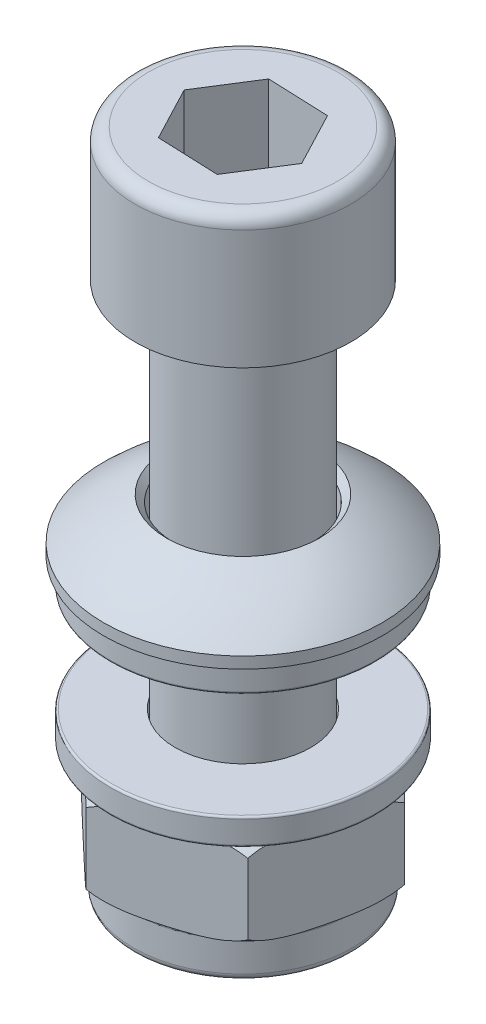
from build123d import *

# Parameters (mm, degrees)
BOSS_EXTRU_1_REACH         = 53.306
ESQUISSE2_R                = 7.135
ESQUISSE5_R                = 16.901676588
ENL_V_MAT_EXTRU_1_DEPTH    = 10
R_P_TITION_LIN_AIRE1_COUNT = 2
R_P_TITION_LIN_AIRE1_PITCH = 10


with BuildPart() as part:
    # Esquisse1 → R_volution1 (revolve)
    with BuildSketch(Plane.XY):
        with BuildLine():
            Line((0, 0), (0, -40))
            Line((0, -40), (-4.4, -40))
            Line((-4.4, -40), (-5, -39.4))
            Line((-5, -39.4), (-5, 0))
            Line((-5, 0), (-8.135, 0))
            Line((-8.135, 0), (-8.135, 9))
            ThreePointArc((-8.135, 9), (-7.842106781, 9.707106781), (-7.135, 10))
            Line((-7.135, 10), (-5, 10))
            Line((-5, 10), (-5, 2.886751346))
            Line((-5, 2.886751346), (0, 0))
        make_face()
    revolve(axis=Axis((0, 0, 0), (0, -1, 0)))

    # Boss.-Extru.1: up to this cone (the profile starts inside it)
    boss_extru_1_end = Plane(origin=(0, 10, 0), z_dir=(0, 1, 0)).offset(-9.999999) * Cone(1.732e-06, 140.515233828, 81.126507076, align=(Align.CENTER, Align.CENTER, Align.MIN), mode=Mode.PRIVATE)
    # Esquisse2 → Boss.-Extru.1 (add, up to the surface)
    with BuildSketch(Plane(origin=(0, 10, 0), x_dir=(1, 0, 0), z_dir=(0, 1, 0)), mode=Mode.PRIVATE) as boss_extru_1_sk1:
        Circle(ESQUISSE2_R)
        Polygon((-2.147341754, 4.089285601), (-4.615096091, 0.184990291), (-2.467754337, -3.90429531), (2.147341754, -4.089285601), (4.615096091, -0.184990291), (2.467754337, 3.90429531), align=None, mode=Mode.SUBTRACT)
    boss_extru_1_tool1 = extrude(boss_extru_1_sk1.sketch, amount=-BOSS_EXTRU_1_REACH, mode=Mode.PRIVATE) & boss_extru_1_end
    add(boss_extru_1_tool1.solids().sort_by_distance((-6.933192, 10, 0))[0])


with BuildPart() as body_2:
    # Esquisse4 → R_volution2 (revolve)
    with BuildSketch(Plane.XY, mode=Mode.PRIVATE) as r_volution2_sk:
        with BuildLine():
            Line((5.1, -28), (9.85, -28))
            ThreePointArc((9.85, -28), (9.956066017, -28.043933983), (10, -28.15))
            Line((10, -28.15), (10, -29.85))
            ThreePointArc((10, -29.85), (9.956066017, -29.956066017), (9.85, -30))
            Line((9.85, -30), (5.1, -30))
            Line((5.1, -30), (5.1, -28))
        make_face()
    revolve(r_volution2_sk.sketch.rotate(Axis((0, 0, 0), (0, -1, 0)), 90), axis=Axis((0, 0, 0), (0, -1, 0)))


with BuildPart() as body_3:
    # Esquisse3 → R_volution3 (revolve)
    with BuildSketch(Plane.XY, mode=Mode.PRIVATE) as r_volution3_sk:
        with BuildLine():
            Line((5.25, -30), (8, -30))
            add(Edge.make_bspline(
                [(8.485518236, -36.946980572), (11.012699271, -36.390790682), (10.789375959, -33.195395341), (10.566052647, -30), (8, -30)],
                knots=[3.315872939, 3.315872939, 3.315872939, 4.799529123, 4.799529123, 6.283185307, 6.283185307, 6.283185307], degree=2, weights=[1, 0.737234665, 1, 0.737234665, 1]))
            ThreePointArc((8.485518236, -36.946980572), (8.31617899, -37.052012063), (8.25, -37.239968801))
            Line((8.25, -37.239968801), (8.25, -39.5))
            ThreePointArc((8.25, -39.5), (8.103553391, -39.853553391), (7.75, -40))
            Line((7.75, -40), (6.75, -40))
            Line((6.75, -40), (6.75, -39.75))
            Line((6.75, -39.75), (5, -39.75))
            Line((5, -39.75), (5, -30.25))
            Line((5, -30.25), (5.25, -30))
        make_face()
    revolve(r_volution3_sk.sketch.rotate(Axis((0, 0, 0), (0, -1, 0)), 90), axis=Axis((0, 0, 0), (0, -1, 0)))

    # Esquisse5 → Enl_v. mat.-Extru.1 (cut)
    with BuildSketch(Plane(origin=(0, -28, 0), x_dir=(1, 0, 0), z_dir=(0, 1, 0))):
        Circle(ESQUISSE5_R)
        Polygon((-9.410770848, -2.787602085), (-2.291251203, -9.543767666), (7.119519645, -6.756165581), (9.410770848, 2.787602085), (2.291251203, 9.543767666), (-7.119519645, 6.756165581), align=None, mode=Mode.SUBTRACT)
    extrude(amount=-ENL_V_MAT_EXTRU_1_DEPTH, mode=Mode.SUBTRACT)


with BuildPart() as r_p_tition_lin_aire1_1:
    # R_p_tition lin_aire1: pattern copy
    add(body_2.part.moved(Location(Vector(0, 1, 0) * (1 * R_P_TITION_LIN_AIRE1_PITCH))))


with BuildPart() as body_5:
    # Esquisse6 → R_volution4 (revolve)
    with BuildSketch(Plane.XY, mode=Mode.PRIVATE) as r_volution4_sk:
        with BuildLine():
            Line((-6.05, -18), (-10.5, -18))
            Line((-10.5, -18), (-10.5, -17.14200836))
            ThreePointArc((-10.5, -17.14200836), (-8.27548664, -15.343502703), (-5.75, -14))
            Line((-5.75, -14), (-5.25, -14.5))
            Line((-5.25, -14.5), (-5.25, -17.2))
            Line((-5.25, -17.2), (-6.05, -18))
        make_face()
    revolve(r_volution4_sk.sketch.rotate(Axis((0, -18.15, 0), (0, -1, 0)), 270), axis=Axis((0, -18.15, 0), (0, -1, 0)))


solid = Compound([part.part, body_2.part, body_3.part, r_p_tition_lin_aire1_1.part, body_5.part])
